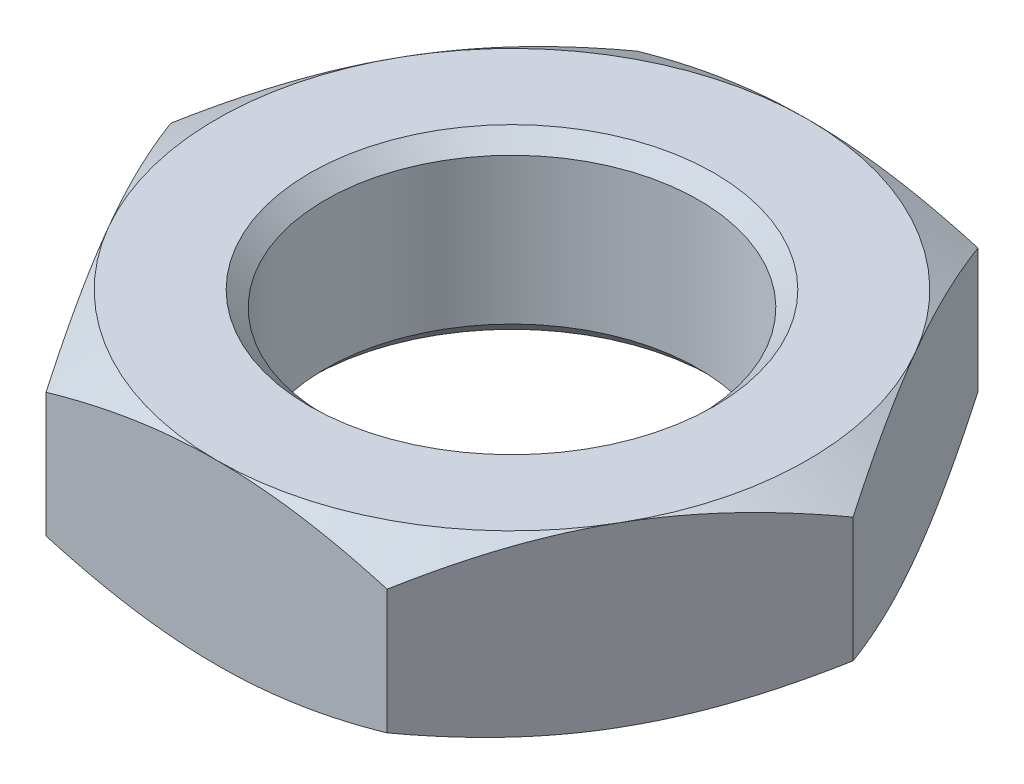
from build123d import *

# Parameters (mm, degrees)
SKETCH1_R           = 6
BOSS_EXTRUDE1_DEPTH = 2.85
CHAMFER1_SIZE       = 0.5


with BuildPart() as part:
    # Sketch1 → Boss-Extrude1 (new, symmetric)
    with BuildSketch(Plane(origin=(0, 0, 0), x_dir=(1, 0, 0), z_dir=(0, 1, 0))):
        Polygon((5.484827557, 9.5), (-5.484827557, 9.5), (-10.969655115, 0), (-5.484827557, -9.5), (5.484827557, -9.5), (10.969655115, 0), align=None)
        with Locations(Location((0, 0, 0), (0, 0, 270))):
            Circle(SKETCH1_R, mode=Mode.SUBTRACT)
    extrude(amount=BOSS_EXTRUDE1_DEPTH, both=True)

    # Sketch2 → Cut-Revolve1 (revolve, cut)
    with BuildSketch(Plane(origin=(0, 0, 0), x_dir=(0, 0, -1), z_dir=(1, 0, 0))):
        Polygon((9.5, 2.85), (17.727241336, 2.85), (17.727241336, -1.9), align=None)
        Polygon((-9.5, -2.85), (-17.727241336, -2.85), (-17.727241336, 1.9), align=None)
    revolve(axis=Axis((0, 2.85, 0), (0, -1, 0)), mode=Mode.SUBTRACT)

    # Chamfer1
    chamfer1_edges = [part.edges().sort_by_distance(p)[0] for p in [
        (0, -2.85, -6),
        (0, 2.85, -6),
    ]]
    chamfer(chamfer1_edges, length=CHAMFER1_SIZE)


solid = part.part
